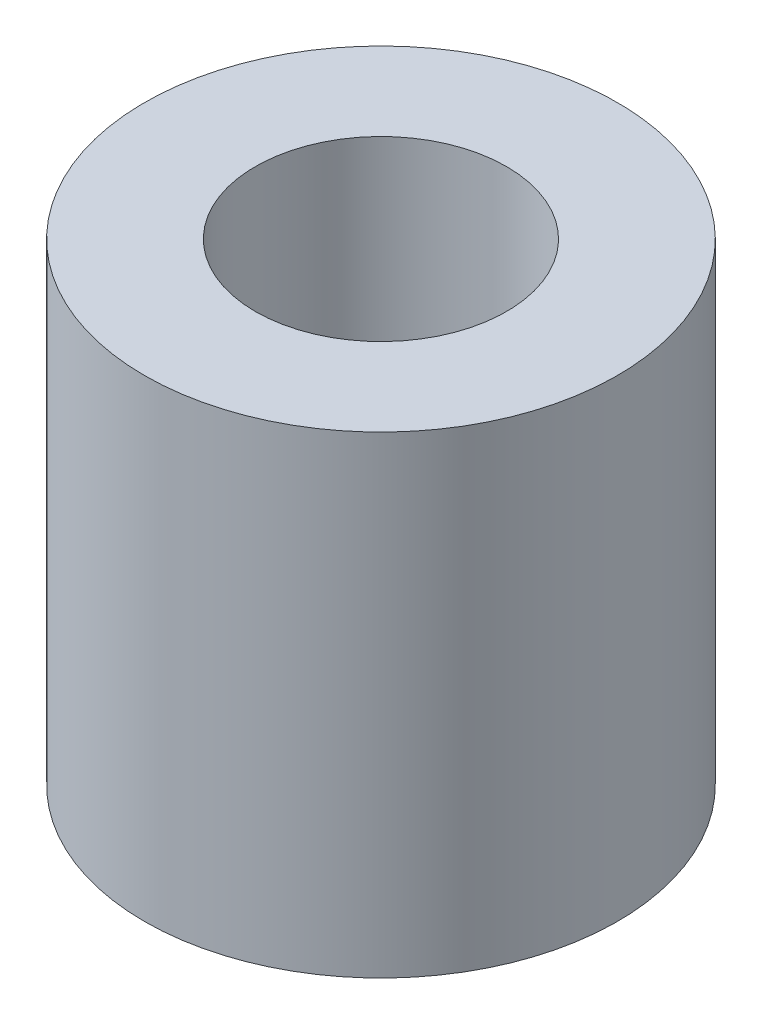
from build123d import *

# Parameters (mm, degrees)
ESQUISSE1_R        = 4
ESQUISSE1_R_2      = 2.125
BOSS_EXTRU_1_DEPTH = 4


with BuildPart() as part:
    # Esquisse1 → Boss.-Extru.1 (new, symmetric)
    with BuildSketch(Plane(origin=(0, 0, 0), x_dir=(1, 0, 0), z_dir=(0, 1, 0))):
        with Locations(Location((0, 0, 0), (0, 0, 270))):
            Circle(ESQUISSE1_R)
        with Locations(Location((0, 0, 0), (0, 0, 270))):
            Circle(ESQUISSE1_R_2, mode=Mode.SUBTRACT)
    extrude(amount=BOSS_EXTRU_1_DEPTH, both=True)


solid = part.part
